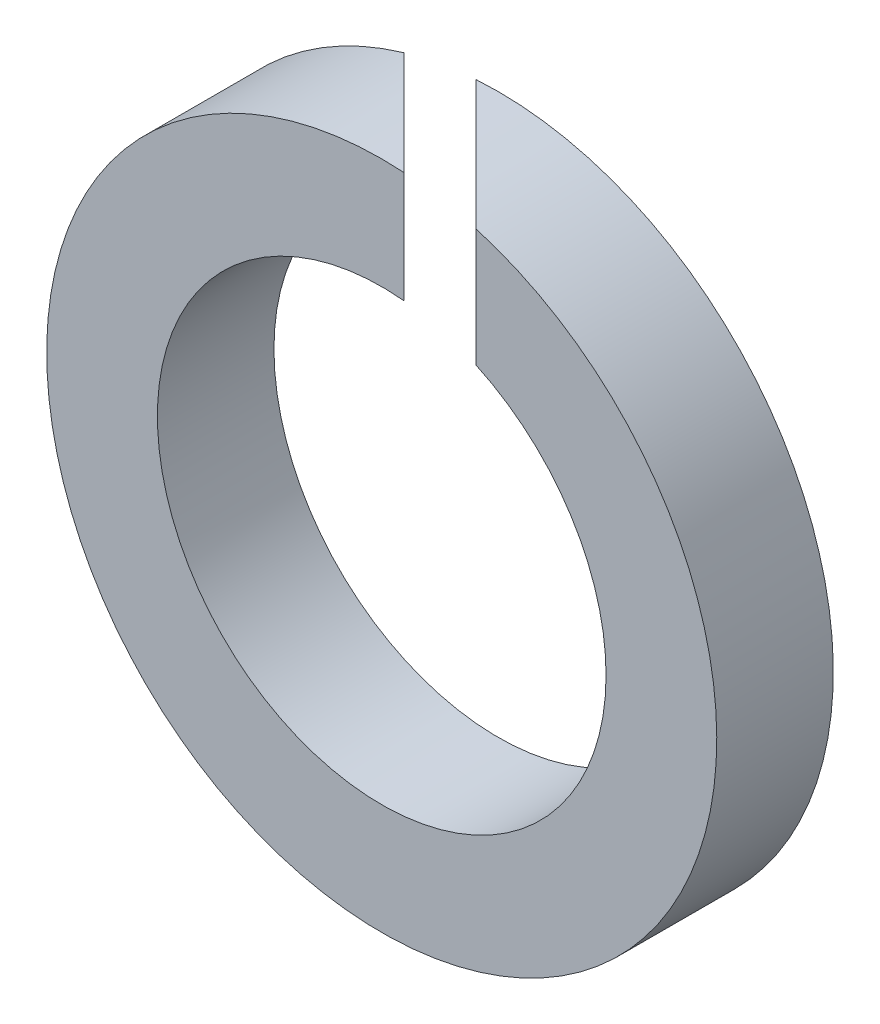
ISO-10303-21;
HEADER;
FILE_DESCRIPTION(('STEP AP214'),'2;1');
FILE_NAME('part.step','',(''),(''),'','','');
FILE_SCHEMA(('AUTOMOTIVE_DESIGN { 1 0 10303 214 1 1 1 1 }'));
ENDSEC;
DATA;
#1=APPLICATION_CONTEXT('core data for automotive mechanical design processes');
#2=APPLICATION_PROTOCOL_DEFINITION('international standard','automotive_design',2000,#1);
#3=PRODUCT_CONTEXT('',#1,'mechanical');
#4=PRODUCT('Part','Part','',(#3));
#5=PRODUCT_RELATED_PRODUCT_CATEGORY('part','',(#4));
#6=PRODUCT_DEFINITION_FORMATION('','',#4);
#7=PRODUCT_DEFINITION_CONTEXT('part definition',#1,'design');
#8=PRODUCT_DEFINITION('design','',#6,#7);
#9=PRODUCT_DEFINITION_SHAPE('','',#8);
#10=(LENGTH_UNIT() NAMED_UNIT(*) SI_UNIT(.MILLI.,.METRE.));
#11=(NAMED_UNIT(*) PLANE_ANGLE_UNIT() SI_UNIT($,.RADIAN.));
#12=(NAMED_UNIT(*) SI_UNIT($,.STERADIAN.) SOLID_ANGLE_UNIT());
#13=UNCERTAINTY_MEASURE_WITH_UNIT(LENGTH_MEASURE(1.E-05),#10,'distance_accuracy_value','');
#14=(GEOMETRIC_REPRESENTATION_CONTEXT(3) GLOBAL_UNCERTAINTY_ASSIGNED_CONTEXT((#13)) GLOBAL_UNIT_ASSIGNED_CONTEXT((#10,
#11,#12)) REPRESENTATION_CONTEXT('',''));
#15=CARTESIAN_POINT('',(0.,0.,0.));
#16=DIRECTION('',(0.,0.,1.));
#17=DIRECTION('',(1.,0.,0.));
#18=AXIS2_PLACEMENT_3D('',#15,#16,#17);
#19=CARTESIAN_POINT('',(0.,0.,4.));
#20=DIRECTION('',(0.,0.,-1.));
#21=DIRECTION('',(-1.,0.,0.));
#22=AXIS2_PLACEMENT_3D('',#19,#20,#21);
#23=CYLINDRICAL_SURFACE('',#22,11.5);
#24=CARTESIAN_POINT('',(0.,0.,3.23743686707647));
#25=DIRECTION('',(0.707106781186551,0.,-0.707106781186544));
#26=DIRECTION('',(-0.707106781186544,0.,-0.707106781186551));
#27=AXIS2_PLACEMENT_3D('',#24,#25,#26);
#28=ELLIPSE('',#27,16.2634559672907,11.5);
#29=CARTESIAN_POINT('',(-3.23743686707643,11.0348992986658,0.));
#30=VERTEX_POINT('',#29);
#31=CARTESIAN_POINT('',(0.762563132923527,11.4746894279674,4.));
#32=VERTEX_POINT('',#31);
#33=EDGE_CURVE('E96',#30,#32,#28,.T.);
#34=ORIENTED_EDGE('',*,*,#33,.F.);
#35=CARTESIAN_POINT('',(0.,0.,0.));
#36=DIRECTION('',(0.,0.,1.));
#37=DIRECTION('',(1.,0.,0.));
#38=AXIS2_PLACEMENT_3D('',#35,#36,#37);
#39=CIRCLE('',#38,11.5);
#40=CARTESIAN_POINT('',(-0.762563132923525,11.4746894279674,0.));
#41=VERTEX_POINT('',#40);
#42=EDGE_CURVE('E98',#30,#41,#39,.T.);
#43=ORIENTED_EDGE('',*,*,#42,.T.);
#44=CARTESIAN_POINT('',(0.,0.,0.762563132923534));
#45=DIRECTION('',(0.707106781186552,0.,-0.707106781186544));
#46=DIRECTION('',(-0.707106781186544,0.,-0.707106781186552));
#47=AXIS2_PLACEMENT_3D('',#44,#45,#46);
#48=ELLIPSE('',#47,16.2634559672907,11.5);
#49=CARTESIAN_POINT('',(3.23743686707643,11.0348992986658,4.));
#50=VERTEX_POINT('',#49);
#51=EDGE_CURVE('E85',#41,#50,#48,.T.);
#52=ORIENTED_EDGE('',*,*,#51,.T.);
#53=CARTESIAN_POINT('',(0.,0.,4.));
#54=DIRECTION('',(0.,0.,1.));
#55=DIRECTION('',(1.,0.,0.));
#56=AXIS2_PLACEMENT_3D('',#53,#54,#55);
#57=CIRCLE('',#56,11.5);
#58=EDGE_CURVE('E38',#32,#50,#57,.T.);
#59=ORIENTED_EDGE('',*,*,#58,.F.);
#60=EDGE_LOOP('',(#34,#43,#52,#59));
#61=FACE_BOUND('',#60,.T.);
#62=ADVANCED_FACE('F31',(#61),#23,.T.);
#63=CARTESIAN_POINT('',(0.,0.,4.));
#64=DIRECTION('',(0.,0.,1.));
#65=DIRECTION('',(1.,0.,0.));
#66=AXIS2_PLACEMENT_3D('',#63,#64,#65);
#67=PLANE('',#66);
#68=CARTESIAN_POINT('',(0.,0.,4.));
#69=DIRECTION('',(0.,0.,-1.));
#70=DIRECTION('',(-1.,0.,0.));
#71=AXIS2_PLACEMENT_3D('',#68,#69,#70);
#72=CIRCLE('',#71,7.7);
#73=CARTESIAN_POINT('',(3.23743686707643,6.98634400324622,4.));
#74=VERTEX_POINT('',#73);
#75=CARTESIAN_POINT('',(0.762563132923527,7.66214705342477,4.));
#76=VERTEX_POINT('',#75);
#77=EDGE_CURVE('E71',#74,#76,#72,.T.);
#78=ORIENTED_EDGE('',*,*,#77,.T.);
#79=DIRECTION('',(0.,-1.,0.));
#80=VECTOR('',#79,1.);
#81=CARTESIAN_POINT('',(0.762563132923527,11.5,4.));
#82=LINE('',#81,#80);
#83=EDGE_CURVE('E88',#32,#76,#82,.T.);
#84=ORIENTED_EDGE('',*,*,#83,.F.);
#85=ORIENTED_EDGE('',*,*,#58,.T.);
#86=DIRECTION('',(0.,-1.,0.));
#87=VECTOR('',#86,1.);
#88=CARTESIAN_POINT('',(3.23743686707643,11.5,4.));
#89=LINE('',#88,#87);
#90=EDGE_CURVE('E86',#50,#74,#89,.T.);
#91=ORIENTED_EDGE('',*,*,#90,.T.);
#92=EDGE_LOOP('',(#78,#84,#85,#91));
#93=FACE_BOUND('',#92,.T.);
#94=ADVANCED_FACE('F103',(#93),#67,.T.);
#95=CARTESIAN_POINT('',(0.,0.,0.));
#96=DIRECTION('',(0.,0.,1.));
#97=DIRECTION('',(1.,0.,0.));
#98=AXIS2_PLACEMENT_3D('',#95,#96,#97);
#99=PLANE('',#98);
#100=DIRECTION('',(0.,-1.,0.));
#101=VECTOR('',#100,1.);
#102=CARTESIAN_POINT('',(-3.23743686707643,11.5,0.));
#103=LINE('',#102,#101);
#104=CARTESIAN_POINT('',(-3.23743686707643,6.98634400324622,0.));
#105=VERTEX_POINT('',#104);
#106=EDGE_CURVE('E51',#30,#105,#103,.T.);
#107=ORIENTED_EDGE('',*,*,#106,.T.);
#108=CARTESIAN_POINT('',(0.,0.,0.));
#109=DIRECTION('',(0.,0.,-1.));
#110=DIRECTION('',(-1.,0.,0.));
#111=AXIS2_PLACEMENT_3D('',#108,#109,#110);
#112=CIRCLE('',#111,7.7);
#113=CARTESIAN_POINT('',(-0.762563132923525,7.66214705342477,0.));
#114=VERTEX_POINT('',#113);
#115=EDGE_CURVE('E44',#114,#105,#112,.T.);
#116=ORIENTED_EDGE('',*,*,#115,.F.);
#117=DIRECTION('',(0.,-1.,0.));
#118=VECTOR('',#117,1.);
#119=CARTESIAN_POINT('',(-0.762563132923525,11.5,0.));
#120=LINE('',#119,#118);
#121=EDGE_CURVE('E76',#41,#114,#120,.T.);
#122=ORIENTED_EDGE('',*,*,#121,.F.);
#123=ORIENTED_EDGE('',*,*,#42,.F.);
#124=EDGE_LOOP('',(#107,#116,#122,#123));
#125=FACE_BOUND('',#124,.T.);
#126=ADVANCED_FACE('F80',(#125),#99,.F.);
#127=CARTESIAN_POINT('',(-0.762563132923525,11.5,0.));
#128=DIRECTION('',(0.707106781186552,0.,-0.707106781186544));
#129=DIRECTION('',(-0.707106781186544,0.,-0.707106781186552));
#130=AXIS2_PLACEMENT_3D('',#127,#128,#129);
#131=PLANE('',#130);
#132=ORIENTED_EDGE('',*,*,#121,.T.);
#133=CARTESIAN_POINT('',(0.,0.,0.762563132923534));
#134=DIRECTION('',(0.707106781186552,0.,-0.707106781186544));
#135=DIRECTION('',(-0.707106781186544,0.,-0.707106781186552));
#136=AXIS2_PLACEMENT_3D('',#133,#134,#135);
#137=ELLIPSE('',#136,10.8894444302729,7.7);
#138=EDGE_CURVE('E68',#114,#74,#137,.T.);
#139=ORIENTED_EDGE('',*,*,#138,.T.);
#140=ORIENTED_EDGE('',*,*,#90,.F.);
#141=ORIENTED_EDGE('',*,*,#51,.F.);
#142=EDGE_LOOP('',(#132,#139,#140,#141));
#143=FACE_BOUND('',#142,.T.);
#144=ADVANCED_FACE('F84',(#143),#131,.F.);
#145=CARTESIAN_POINT('',(-3.23743686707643,11.5,0.));
#146=DIRECTION('',(0.707106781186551,0.,-0.707106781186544));
#147=DIRECTION('',(-0.707106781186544,0.,-0.707106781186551));
#148=AXIS2_PLACEMENT_3D('',#145,#146,#147);
#149=PLANE('',#148);
#150=CARTESIAN_POINT('',(0.,0.,3.23743686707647));
#151=DIRECTION('',(0.707106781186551,0.,-0.707106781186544));
#152=DIRECTION('',(-0.707106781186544,0.,-0.707106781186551));
#153=AXIS2_PLACEMENT_3D('',#150,#151,#152);
#154=ELLIPSE('',#153,10.8894444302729,7.7);
#155=EDGE_CURVE('E11',#105,#76,#154,.T.);
#156=ORIENTED_EDGE('',*,*,#155,.F.);
#157=ORIENTED_EDGE('',*,*,#106,.F.);
#158=ORIENTED_EDGE('',*,*,#33,.T.);
#159=ORIENTED_EDGE('',*,*,#83,.T.);
#160=EDGE_LOOP('',(#156,#157,#158,#159));
#161=FACE_BOUND('',#160,.T.);
#162=ADVANCED_FACE('F105',(#161),#149,.T.);
#163=CARTESIAN_POINT('',(0.,0.,4.));
#164=DIRECTION('',(0.,0.,-1.));
#165=DIRECTION('',(-1.,0.,0.));
#166=AXIS2_PLACEMENT_3D('',#163,#164,#165);
#167=CYLINDRICAL_SURFACE('',#166,7.7);
#168=ORIENTED_EDGE('',*,*,#115,.T.);
#169=ORIENTED_EDGE('',*,*,#155,.T.);
#170=ORIENTED_EDGE('',*,*,#77,.F.);
#171=ORIENTED_EDGE('',*,*,#138,.F.);
#172=EDGE_LOOP('',(#168,#169,#170,#171));
#173=FACE_BOUND('',#172,.T.);
#174=ADVANCED_FACE('F69',(#173),#167,.F.);
#175=CLOSED_SHELL('',(#62,#94,#126,#144,#162,#174));
#176=MANIFOLD_SOLID_BREP('B2',#175);
#177=ADVANCED_BREP_SHAPE_REPRESENTATION('',(#18,#176),#14);
#178=SHAPE_DEFINITION_REPRESENTATION(#9,#177);
ENDSEC;
END-ISO-10303-21;
